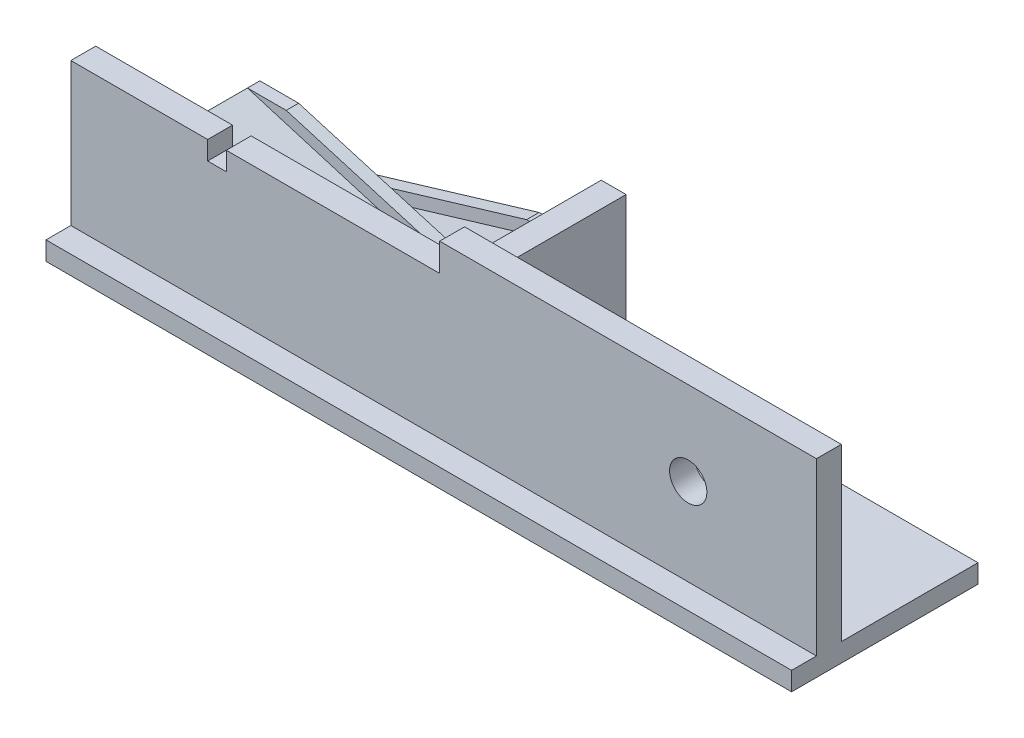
from build123d import *

# Parameters (mm, degrees)
CROQUIS1_W              = 12000
CROQUIS1_H              = 3000
SALIENTE_EXTRUIR1_DEPTH = 300
CROQUIS2_W              = 12000
CROQUIS2_H              = 400
SALIENTE_EXTRUIR2_DEPTH = 2300
CROQUIS3_W              = 300
CROQUIS3_H              = 300
CORTAR_EXTRUIR1_DEPTH   = 2300
CROQUIS4_R              = 300
CORTAR_EXTRUIR2_DEPTH   = 2300
CROQUIS5_W              = 400
CROQUIS5_H              = 2200
SALIENTE_EXTRUIR3_DEPTH = 2300
CROQUIS6_W              = 6063.926940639
CROQUIS6_H              = 400
SALIENTE_EXTRUIR4_DEPTH = 450
SALIENTE_EXTRUIR5_DEPTH = 1000
SALIENTE_EXTRUIR6_DEPTH = 2000
SALIENTE_EXTRUIR7_DEPTH = 200
CORTAR_EXTRUIR3_DEPTH   = 1642
SALIENTE_EXTRUIR8_DEPTH = 200


with BuildPart() as part:
    # Croquis1 → Saliente-Extruir1 (new body)
    with BuildSketch(Plane(origin=(0, 0, 0), x_dir=(1, 0, 0), z_dir=(0, 1, 0))):
        with Locations((63.926940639, 1500)):
            Rectangle(CROQUIS1_W, CROQUIS1_H)
    extrude(amount=SALIENTE_EXTRUIR1_DEPTH)

    # Croquis2 → Saliente-Extruir2 (add)
    with BuildSketch(Plane(origin=(0, 300, 0), x_dir=(1, 0, 0), z_dir=(0, 1, 0))):
        with Locations((63.926940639, 600)):
            Rectangle(CROQUIS2_W, CROQUIS2_H)
    extrude(amount=SALIENTE_EXTRUIR2_DEPTH)

    # Croquis3 → Cortar-Extruir1 (cut)
    with BuildSketch(Plane.XY.offset(-400)):
        with Locations((-3584.225410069, 2450)):
            Rectangle(CROQUIS3_W, CROQUIS3_H)
    extrude(amount=-CORTAR_EXTRUIR1_DEPTH, mode=Mode.SUBTRACT)

    # Croquis4 → Cortar-Extruir2 (cut)
    with BuildSketch(Plane.XY.offset(-400)):
        with Locations((4000, 1700)):
            Circle(CROQUIS4_R)
    extrude(amount=-CORTAR_EXTRUIR2_DEPTH, mode=Mode.SUBTRACT)

    # Croquis5 → Saliente-Extruir3 (add)
    with BuildSketch(Plane(origin=(0, 300, 0), x_dir=(1, 0, 0), z_dir=(0, 1, 0))):
        with Locations((200, 1900)):
            Rectangle(CROQUIS5_W, CROQUIS5_H)
    extrude(amount=SALIENTE_EXTRUIR3_DEPTH)

    # Croquis6 → Saliente-Extruir4 (add)
    with BuildSketch(Plane(origin=(0, 2600, 0), x_dir=(1, 0, 0), z_dir=(0, 1, 0))):
        with Locations((3031.96347032, 600)):
            Rectangle(CROQUIS6_W, CROQUIS6_H)
    extrude(amount=SALIENTE_EXTRUIR4_DEPTH)

    # Croquis7 → Saliente-Extruir5 (add)
    with BuildSketch(Plane(origin=(0, 0, -800), x_dir=(-1, 0, 0), z_dir=(0, 0, -1))):
        Polygon((1000, 1450), (4835.149234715, 2600), (5936.073059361, 2600), (5936.073059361, 300), (4835.149234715, 300), align=None)
    extrude(amount=SALIENTE_EXTRUIR5_DEPTH)

    # Croquis8 → Saliente-Extruir6 (add)
    with BuildSketch(Plane(origin=(0, 0, -800), x_dir=(-1, 0, 0), z_dir=(0, 0, -1))):
        Polygon((4835.149234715, 300), (1000, 1450), (1000, 950), (0, 950), (0, 300), align=None)
    extrude(amount=SALIENTE_EXTRUIR6_DEPTH)

    # Croquis9 → Saliente-Extruir7 (add)
    with BuildSketch(Plane(origin=(0, 0, -2800), x_dir=(-1, 0, 0), z_dir=(0, 0, -1))):
        Polygon((1000, 1650), (0, 1650), (0, 300), (4835.149234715, 300), (4835.149234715, 500), align=None)
    extrude(amount=SALIENTE_EXTRUIR7_DEPTH)

    # Croquis10 → Cortar-Extruir3 (cut)
    with BuildSketch(Plane.ZY.offset(5936.073059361)):
        Polygon((-800, 2600), (-1800, 300), (-1800, 2600), align=None)
    extrude(amount=-CORTAR_EXTRUIR3_DEPTH, mode=Mode.SUBTRACT)

    # Croquis11 → Saliente-Extruir8 (add)
    with BuildSketch(Plane(origin=(0, 0, -1800), x_dir=(-1, 0, 0), z_dir=(0, 0, -1))):
        Polygon((4294.073059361, 2437.754005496), (3670.184276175, 2437.754005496), (1000, 1650), (1000, 1450), (4294.073059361, 462.245994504), align=None)
    extrude(amount=-SALIENTE_EXTRUIR8_DEPTH)


solid = part.part
